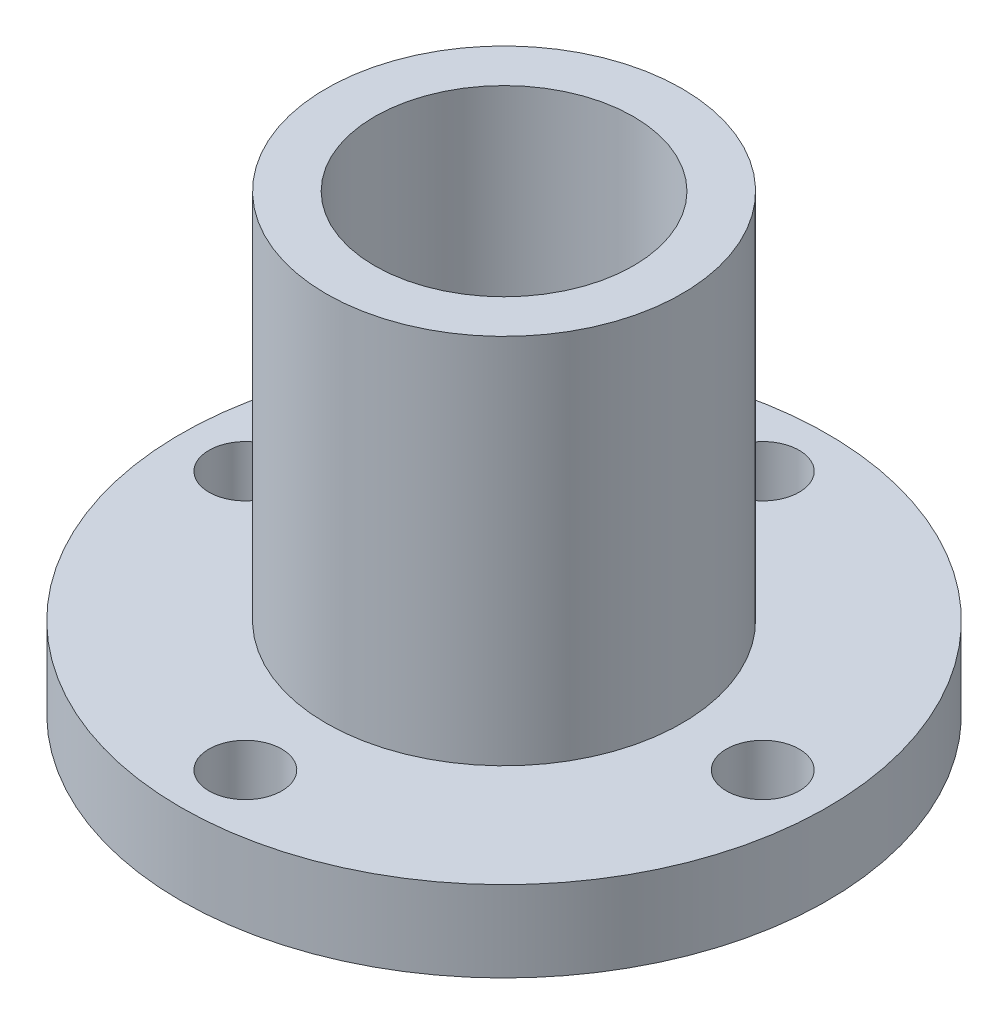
from build123d import *

# Parameters (mm, degrees)
SKETCH_1_R          = 20
EXTRUDE_1_DEPTH     = 28
SKETCH_2_OUTSIDE_W  = 54.624
SKETCH_2_OUTSIDE_H  = 54.624
SKETCH_2_OUTSIDE_R  = 11
CUT_EXTRUDE_1_DEPTH = 23
SKETCH_3_R          = 8
CUT_EXTRUDE_2_DEPTH = 28
SKETCH_4_R          = 2.25
CUT_EXTRUDE_3_DEPTH = 5


with BuildPart() as part:
    # Sketch 1 → Extrude 1 (new body)
    with BuildSketch(Plane(origin=(0, 0, 0), x_dir=(1, 0, 0), z_dir=(0, 1, 0))):
        with Locations(Location((0, 0, 0), (0, 0, 270))):
            Circle(SKETCH_1_R)
    extrude(amount=EXTRUDE_1_DEPTH)

    # Sketch 2 outside → Cut-Extrude 1 (cut)
    with BuildSketch(Plane(origin=(0, 28, 0), x_dir=(1, 0, 0), z_dir=(0, 1, 0))):
        Rectangle(SKETCH_2_OUTSIDE_W, SKETCH_2_OUTSIDE_H)
        with Locations(Location((0, 0, 0), (0, 0, 270))):
            Circle(SKETCH_2_OUTSIDE_R, mode=Mode.SUBTRACT)
    extrude(amount=-CUT_EXTRUDE_1_DEPTH, mode=Mode.SUBTRACT)

    # Sketch 3 → Cut-Extrude 2 (cut)
    with BuildSketch(Plane(origin=(0, 28, 0), x_dir=(1, 0, 0), z_dir=(0, 1, 0))):
        with Locations(Location((0, 0, 0), (0, 0, 270))):
            Circle(SKETCH_3_R)
    extrude(amount=-CUT_EXTRUDE_2_DEPTH, mode=Mode.SUBTRACT)

    # Sketch 4 → Cut-Extrude 3 (cut)
    with BuildSketch(Plane.XZ):
        with Locations(Location((0, 16, 0), (0, 0, 270))):
            Circle(SKETCH_4_R)
        with Locations(Location((16, 0, 0), (0, 0, 270))):
            Circle(SKETCH_4_R)
        with Locations(Location((0, -16, 0), (0, 0, 90))):
            Circle(SKETCH_4_R)
        with Locations(Location((-16, 0, 0), (0, 0, 90))):
            Circle(SKETCH_4_R)
    extrude(amount=-CUT_EXTRUDE_3_DEPTH, mode=Mode.SUBTRACT)


solid = part.part
